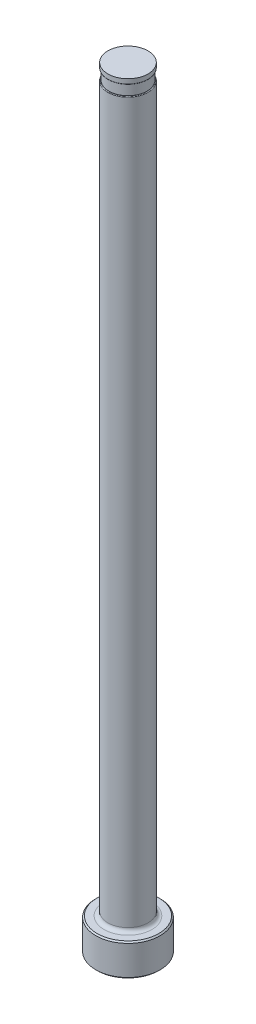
ISO-10303-21;
HEADER;
FILE_DESCRIPTION(('STEP AP214'),'2;1');
FILE_NAME('part.step','',(''),(''),'','','');
FILE_SCHEMA(('AUTOMOTIVE_DESIGN { 1 0 10303 214 1 1 1 1 }'));
ENDSEC;
DATA;
#1=APPLICATION_CONTEXT('core data for automotive mechanical design processes');
#2=APPLICATION_PROTOCOL_DEFINITION('international standard','automotive_design',2000,#1);
#3=PRODUCT_CONTEXT('',#1,'mechanical');
#4=PRODUCT('Part','Part','',(#3));
#5=PRODUCT_RELATED_PRODUCT_CATEGORY('part','',(#4));
#6=PRODUCT_DEFINITION_FORMATION('','',#4);
#7=PRODUCT_DEFINITION_CONTEXT('part definition',#1,'design');
#8=PRODUCT_DEFINITION('design','',#6,#7);
#9=PRODUCT_DEFINITION_SHAPE('','',#8);
#10=(LENGTH_UNIT() NAMED_UNIT(*) SI_UNIT(.MILLI.,.METRE.));
#11=(NAMED_UNIT(*) PLANE_ANGLE_UNIT() SI_UNIT($,.RADIAN.));
#12=(NAMED_UNIT(*) SI_UNIT($,.STERADIAN.) SOLID_ANGLE_UNIT());
#13=UNCERTAINTY_MEASURE_WITH_UNIT(LENGTH_MEASURE(1.E-05),#10,'distance_accuracy_value','');
#14=(GEOMETRIC_REPRESENTATION_CONTEXT(3) GLOBAL_UNCERTAINTY_ASSIGNED_CONTEXT((#13)) GLOBAL_UNIT_ASSIGNED_CONTEXT((#10,
#11,#12)) REPRESENTATION_CONTEXT('',''));
#15=CARTESIAN_POINT('',(0.,0.,0.));
#16=DIRECTION('',(0.,0.,1.));
#17=DIRECTION('',(1.,0.,0.));
#18=AXIS2_PLACEMENT_3D('',#15,#16,#17);
#19=CARTESIAN_POINT('',(-3.96874999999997,151.384,0.));
#20=DIRECTION('',(0.,1.,0.));
#21=DIRECTION('',(0.,0.,1.));
#22=AXIS2_PLACEMENT_3D('',#19,#20,#21);
#23=PLANE('',#22);
#24=CARTESIAN_POINT('',(0.,151.384,0.));
#25=DIRECTION('',(0.,1.,0.));
#26=DIRECTION('',(0.,0.,1.));
#27=AXIS2_PLACEMENT_3D('',#24,#25,#26);
#28=CIRCLE('',#27,3.83666999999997);
#29=CARTESIAN_POINT('',(0.,151.384,3.83666999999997));
#30=VERTEX_POINT('',#29);
#31=EDGE_CURVE('E11',#30,#30,#28,.F.);
#32=ORIENTED_EDGE('',*,*,#31,.T.);
#33=EDGE_LOOP('',(#32));
#34=FACE_BOUND('',#33,.T.);
#35=CARTESIAN_POINT('',(0.,151.384,0.));
#36=DIRECTION('',(0.,1.,0.));
#37=DIRECTION('',(0.,0.,1.));
#38=AXIS2_PLACEMENT_3D('',#35,#36,#37);
#39=CIRCLE('',#38,3.76554999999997);
#40=CARTESIAN_POINT('',(0.,151.384,3.76554999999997));
#41=VERTEX_POINT('',#40);
#42=EDGE_CURVE('E78',#41,#41,#39,.T.);
#43=ORIENTED_EDGE('',*,*,#42,.T.);
#44=EDGE_LOOP('',(#43));
#45=FACE_BOUND('',#44,.T.);
#46=ADVANCED_FACE('F36',(#34,#45),#23,.F.);
#47=CARTESIAN_POINT('',(0.,259.958771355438,0.));
#48=DIRECTION('',(0.,1.,0.));
#49=DIRECTION('',(0.,0.,1.));
#50=AXIS2_PLACEMENT_3D('',#47,#48,#49);
#51=CYLINDRICAL_SURFACE('',#50,3.96874999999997);
#52=DIRECTION('',(0.,1.,0.));
#53=VECTOR('',#52,1.);
#54=CARTESIAN_POINT('',(-3.76554999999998,259.958771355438,-1.25363860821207));
#55=LINE('',#54,#53);
#56=CARTESIAN_POINT('',(-3.76554999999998,149.225,-1.25363860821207));
#57=VERTEX_POINT('',#56);
#58=CARTESIAN_POINT('',(-3.76554999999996,86.868,-1.25363860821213));
#59=VERTEX_POINT('',#58);
#60=EDGE_CURVE('E73',#57,#59,#55,.F.);
#61=ORIENTED_EDGE('',*,*,#60,.F.);
#62=CARTESIAN_POINT('',(0.,149.225,0.));
#63=DIRECTION('',(0.,-1.,0.));
#64=DIRECTION('',(0.,0.,-1.));
#65=AXIS2_PLACEMENT_3D('',#62,#63,#64);
#66=CIRCLE('',#65,3.96874999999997);
#67=CARTESIAN_POINT('',(-3.76554999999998,149.225,1.25363860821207));
#68=VERTEX_POINT('',#67);
#69=EDGE_CURVE('E51',#57,#68,#66,.T.);
#70=ORIENTED_EDGE('',*,*,#69,.T.);
#71=DIRECTION('',(0.,1.,0.));
#72=VECTOR('',#71,1.);
#73=CARTESIAN_POINT('',(-3.76554999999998,259.958771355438,1.25363860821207));
#74=LINE('',#73,#72);
#75=CARTESIAN_POINT('',(-3.76554999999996,86.868,1.25363860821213));
#76=VERTEX_POINT('',#75);
#77=EDGE_CURVE('E84',#76,#68,#74,.T.);
#78=ORIENTED_EDGE('',*,*,#77,.F.);
#79=CARTESIAN_POINT('',(-3.76554999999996,86.868,-1.25363860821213));
#80=CARTESIAN_POINT('',(-3.76554761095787,86.8382664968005,-1.25363893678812));
#81=CARTESIAN_POINT('',(-3.76596820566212,86.8085487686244,-1.25238314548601));
#82=CARTESIAN_POINT('',(-3.76762981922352,86.7493538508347,-1.24737825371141));
#83=CARTESIAN_POINT('',(-3.76887065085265,86.7198766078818,-1.24362972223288));
#84=CARTESIAN_POINT('',(-3.77377172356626,86.6323445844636,-1.22871446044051));
#85=CARTESIAN_POINT('',(-3.7786109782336,86.5749361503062,-1.21387766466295));
#86=CARTESIAN_POINT('',(-3.79089599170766,86.4637164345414,-1.17494432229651));
#87=CARTESIAN_POINT('',(-3.79834108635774,86.4099042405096,-1.15085013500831));
#88=CARTESIAN_POINT('',(-3.81503450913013,86.3072087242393,-1.09423745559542));
#89=CARTESIAN_POINT('',(-3.82428345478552,86.2583270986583,-1.06171607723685));
#90=CARTESIAN_POINT('',(-3.84371902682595,86.166215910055,-0.989050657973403));
#91=CARTESIAN_POINT('',(-3.85391232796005,86.1230327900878,-0.948849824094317));
#92=CARTESIAN_POINT('',(-3.87421414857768,86.043439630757,-0.862218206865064));
#93=CARTESIAN_POINT('',(-3.88432263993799,86.0070317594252,-0.815785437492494));
#94=CARTESIAN_POINT('',(-3.90447970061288,85.9383203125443,-0.713424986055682));
#95=CARTESIAN_POINT('',(-3.91443636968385,85.9067071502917,-0.657016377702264));
#96=CARTESIAN_POINT('',(-3.93230837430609,85.8521594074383,-0.539855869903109));
#97=CARTESIAN_POINT('',(-3.94022284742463,85.8292284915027,-0.479102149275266));
#98=CARTESIAN_POINT('',(-3.95405226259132,85.7900681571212,-0.34816359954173));
#99=CARTESIAN_POINT('',(-3.95966879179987,85.774798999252,-0.277659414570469));
#100=CARTESIAN_POINT('',(-3.96709876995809,85.7547501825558,-0.134969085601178));
#101=CARTESIAN_POINT('',(-3.96891039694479,85.7499755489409,-0.0627821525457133));
#102=CARTESIAN_POINT('',(-3.96855474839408,85.7509169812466,0.086880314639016));
#103=CARTESIAN_POINT('',(-3.96608295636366,85.7574359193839,0.164351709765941));
#104=CARTESIAN_POINT('',(-3.95680487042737,85.7826115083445,0.317057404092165));
#105=CARTESIAN_POINT('',(-3.94999780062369,85.8012703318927,0.392291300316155));
#106=CARTESIAN_POINT('',(-3.93277618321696,85.8508426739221,0.538182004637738));
#107=CARTESIAN_POINT('',(-3.92236273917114,85.8817524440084,0.60884020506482));
#108=CARTESIAN_POINT('',(-3.8991687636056,85.9557930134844,0.743029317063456));
#109=CARTESIAN_POINT('',(-3.8863895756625,85.9989168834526,0.806564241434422));
#110=CARTESIAN_POINT('',(-3.86127801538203,86.092843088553,0.919000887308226));
#111=CARTESIAN_POINT('',(-3.84899411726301,86.1427331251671,0.968673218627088));
#112=CARTESIAN_POINT('',(-3.82552074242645,86.2513276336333,1.05758636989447));
#113=CARTESIAN_POINT('',(-3.81433058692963,86.3100265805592,1.09683368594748));
#114=CARTESIAN_POINT('',(-3.79578266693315,86.4273369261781,1.15929047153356));
#115=CARTESIAN_POINT('',(-3.78813455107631,86.4852068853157,1.18381204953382));
#116=CARTESIAN_POINT('',(-3.77592606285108,86.604640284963,1.22219984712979));
#117=CARTESIAN_POINT('',(-3.77135975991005,86.6661963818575,1.23608653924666));
#118=CARTESIAN_POINT('',(-3.76759831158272,86.7516117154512,1.24747178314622));
#119=CARTESIAN_POINT('',(-3.76683119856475,86.774841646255,1.24978469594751));
#120=CARTESIAN_POINT('',(-3.76580747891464,86.8213769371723,1.25286606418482));
#121=CARTESIAN_POINT('',(-3.76555004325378,86.8446821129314,1.25363702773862));
#122=CARTESIAN_POINT('',(-3.76554999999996,86.868,1.25363860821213));
#123=B_SPLINE_CURVE_WITH_KNOTS('',3,(#79,#80,#81,#82,#83,#84,#85,#86,#87,#88,#89,#90,#91,#92,
#93,#94,#95,#96,#97,#98,#99,#100,#101,#102,#103,#104,#105,#106,#107,#108,#109,#110,#111,#112,
#113,#114,#115,#116,#117,#118,#119,#120,#121,#122),.UNSPECIFIED.,.F.,.F.,(4,2,2,2,2,2,2,2,2,2,2,
2,2,2,2,2,2,2,2,2,2,4),(0.,0.0891400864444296,0.178259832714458,0.355749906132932,
0.533194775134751,0.710700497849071,0.88957367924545,1.06850400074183,1.26397301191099,
1.45952443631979,1.67567306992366,1.89192518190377,2.12418795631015,2.35649231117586,
2.58872564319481,2.82082748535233,3.03401201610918,3.24706339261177,3.43601078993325,
3.62459353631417,3.69462175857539,3.76453598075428),.UNSPECIFIED.);
#124=EDGE_CURVE('E81',#59,#76,#123,.T.);
#125=ORIENTED_EDGE('',*,*,#124,.F.);
#126=EDGE_LOOP('',(#61,#70,#78,#125));
#127=FACE_BOUND('',#126,.T.);
#128=CARTESIAN_POINT('',(0.,7.11200000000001,0.));
#129=DIRECTION('',(0.,1.,0.));
#130=DIRECTION('',(0.,0.,1.));
#131=AXIS2_PLACEMENT_3D('',#128,#129,#130);
#132=CIRCLE('',#131,3.96874999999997);
#133=CARTESIAN_POINT('',(0.,7.11200000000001,3.96874999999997));
#134=VERTEX_POINT('',#133);
#135=EDGE_CURVE('E116',#134,#134,#132,.T.);
#136=ORIENTED_EDGE('',*,*,#135,.T.);
#137=EDGE_LOOP('',(#136));
#138=FACE_BOUND('',#137,.T.);
#139=ADVANCED_FACE('F82',(#127,#138),#51,.T.);
#140=CARTESIAN_POINT('',(0.,0.,0.));
#141=DIRECTION('',(0.,-1.,0.));
#142=DIRECTION('',(0.,0.,-1.));
#143=AXIS2_PLACEMENT_3D('',#140,#141,#142);
#144=PLANE('',#143);
#145=CARTESIAN_POINT('',(0.,0.,0.));
#146=DIRECTION('',(0.,-1.,0.));
#147=DIRECTION('',(0.,0.,-1.));
#148=AXIS2_PLACEMENT_3D('',#145,#146,#147);
#149=CIRCLE('',#148,6.09599999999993);
#150=CARTESIAN_POINT('',(0.,0.,-6.09599999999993));
#151=VERTEX_POINT('',#150);
#152=EDGE_CURVE('E113',#151,#151,#149,.T.);
#153=ORIENTED_EDGE('',*,*,#152,.T.);
#154=EDGE_LOOP('',(#153));
#155=FACE_BOUND('',#154,.T.);
#156=ADVANCED_FACE('F192',(#155),#144,.T.);
#157=CARTESIAN_POINT('',(0.,259.958771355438,0.));
#158=DIRECTION('',(0.,1.,0.));
#159=DIRECTION('',(0.,0.,1.));
#160=AXIS2_PLACEMENT_3D('',#157,#158,#159);
#161=CYLINDRICAL_SURFACE('',#160,6.34999999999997);
#162=CARTESIAN_POINT('',(0.,6.09599999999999,0.));
#163=DIRECTION('',(0.,1.,0.));
#164=DIRECTION('',(0.,0.,1.));
#165=AXIS2_PLACEMENT_3D('',#162,#163,#164);
#166=CIRCLE('',#165,6.34999999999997);
#167=CARTESIAN_POINT('',(0.,6.09599999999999,6.34999999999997));
#168=VERTEX_POINT('',#167);
#169=EDGE_CURVE('E110',#168,#168,#166,.F.);
#170=ORIENTED_EDGE('',*,*,#169,.T.);
#171=EDGE_LOOP('',(#170));
#172=FACE_BOUND('',#171,.T.);
#173=CARTESIAN_POINT('',(0.,0.254000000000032,0.));
#174=DIRECTION('',(0.,-1.,0.));
#175=DIRECTION('',(0.,0.,-1.));
#176=AXIS2_PLACEMENT_3D('',#173,#174,#175);
#177=CIRCLE('',#176,6.34999999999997);
#178=CARTESIAN_POINT('',(0.,0.254000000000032,-6.34999999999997));
#179=VERTEX_POINT('',#178);
#180=EDGE_CURVE('E107',#179,#179,#177,.F.);
#181=ORIENTED_EDGE('',*,*,#180,.T.);
#182=EDGE_LOOP('',(#181));
#183=FACE_BOUND('',#182,.T.);
#184=ADVANCED_FACE('F195',(#172,#183),#161,.T.);
#185=CARTESIAN_POINT('',(-6.34999999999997,6.35,0.));
#186=DIRECTION('',(0.,1.,0.));
#187=DIRECTION('',(0.,0.,1.));
#188=AXIS2_PLACEMENT_3D('',#185,#186,#187);
#189=PLANE('',#188);
#190=CARTESIAN_POINT('',(0.,6.35,0.));
#191=DIRECTION('',(0.,1.,0.));
#192=DIRECTION('',(0.,0.,1.));
#193=AXIS2_PLACEMENT_3D('',#190,#191,#192);
#194=CIRCLE('',#193,4.73074999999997);
#195=CARTESIAN_POINT('',(0.,6.35,4.73074999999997));
#196=VERTEX_POINT('',#195);
#197=EDGE_CURVE('E87',#196,#196,#194,.F.);
#198=ORIENTED_EDGE('',*,*,#197,.T.);
#199=EDGE_LOOP('',(#198));
#200=FACE_BOUND('',#199,.T.);
#201=CARTESIAN_POINT('',(0.,6.35,0.));
#202=DIRECTION('',(0.,1.,0.));
#203=DIRECTION('',(0.,0.,1.));
#204=AXIS2_PLACEMENT_3D('',#201,#202,#203);
#205=CIRCLE('',#204,6.096);
#206=CARTESIAN_POINT('',(0.,6.35,6.096));
#207=VERTEX_POINT('',#206);
#208=EDGE_CURVE('E104',#207,#207,#205,.T.);
#209=ORIENTED_EDGE('',*,*,#208,.T.);
#210=EDGE_LOOP('',(#209));
#211=FACE_BOUND('',#210,.T.);
#212=ADVANCED_FACE('F190',(#200,#211),#189,.T.);
#213=CARTESIAN_POINT('',(0.,6.35000000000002,0.));
#214=DIRECTION('',(0.,-1.,0.));
#215=DIRECTION('',(0.,0.,-1.));
#216=AXIS2_PLACEMENT_3D('',#213,#214,#215);
#217=CONICAL_SURFACE('',#216,6.09599999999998,0.78539816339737);
#218=ORIENTED_EDGE('',*,*,#169,.F.);
#219=EDGE_LOOP('',(#218));
#220=FACE_BOUND('',#219,.T.);
#221=ORIENTED_EDGE('',*,*,#208,.F.);
#222=EDGE_LOOP('',(#221));
#223=FACE_BOUND('',#222,.T.);
#224=ADVANCED_FACE('F186',(#220,#223),#217,.T.);
#225=CARTESIAN_POINT('',(0.,0.254000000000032,0.));
#226=DIRECTION('',(0.,1.,0.));
#227=DIRECTION('',(0.,0.,1.));
#228=AXIS2_PLACEMENT_3D('',#225,#226,#227);
#229=CONICAL_SURFACE('',#228,6.34999999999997,0.785398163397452);
#230=ORIENTED_EDGE('',*,*,#152,.F.);
#231=EDGE_LOOP('',(#230));
#232=FACE_BOUND('',#231,.T.);
#233=ORIENTED_EDGE('',*,*,#180,.F.);
#234=EDGE_LOOP('',(#233));
#235=FACE_BOUND('',#234,.T.);
#236=ADVANCED_FACE('F182',(#232,#235),#229,.T.);
#237=CARTESIAN_POINT('',(0.,7.11200000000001,0.));
#238=DIRECTION('',(0.,1.,0.));
#239=DIRECTION('',(0.,0.,1.));
#240=AXIS2_PLACEMENT_3D('',#237,#238,#239);
#241=TOROIDAL_SURFACE('',#240,4.73074999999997,0.762);
#242=ORIENTED_EDGE('',*,*,#197,.F.);
#243=EDGE_LOOP('',(#242));
#244=FACE_BOUND('',#243,.T.);
#245=ORIENTED_EDGE('',*,*,#135,.F.);
#246=EDGE_LOOP('',(#245));
#247=FACE_BOUND('',#246,.T.);
#248=ADVANCED_FACE('F147',(#244,#247),#241,.F.);
#249=CARTESIAN_POINT('',(-3.96874999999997,149.352,0.));
#250=DIRECTION('',(0.,-1.,0.));
#251=DIRECTION('',(0.,0.,-1.));
#252=AXIS2_PLACEMENT_3D('',#249,#250,#251);
#253=PLANE('',#252);
#254=DIRECTION('',(0.,0.,1.));
#255=VECTOR('',#254,1.);
#256=CARTESIAN_POINT('',(-3.76554999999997,149.352,0.));
#257=LINE('',#256,#255);
#258=CARTESIAN_POINT('',(-3.76554999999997,149.352,0.));
#259=VERTEX_POINT('',#258);
#260=CARTESIAN_POINT('',(-3.76554999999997,149.352,0.761364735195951));
#261=VERTEX_POINT('',#260);
#262=EDGE_CURVE('E90',#259,#261,#257,.T.);
#263=ORIENTED_EDGE('',*,*,#262,.T.);
#264=CARTESIAN_POINT('',(0.,149.352,0.));
#265=DIRECTION('',(0.,-1.,0.));
#266=DIRECTION('',(0.,0.,-1.));
#267=AXIS2_PLACEMENT_3D('',#264,#265,#266);
#268=CIRCLE('',#267,3.84174999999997);
#269=CARTESIAN_POINT('',(-3.76554999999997,149.352,-0.761364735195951));
#270=VERTEX_POINT('',#269);
#271=EDGE_CURVE('E86',#261,#270,#268,.F.);
#272=ORIENTED_EDGE('',*,*,#271,.T.);
#273=EDGE_CURVE('E79',#270,#259,#257,.T.);
#274=ORIENTED_EDGE('',*,*,#273,.T.);
#275=CARTESIAN_POINT('',(0.,149.352,0.));
#276=DIRECTION('',(0.,1.,0.));
#277=DIRECTION('',(0.,0.,1.));
#278=AXIS2_PLACEMENT_3D('',#275,#276,#277);
#279=CIRCLE('',#278,3.76554999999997);
#280=EDGE_CURVE('E101',#259,#259,#279,.T.);
#281=ORIENTED_EDGE('',*,*,#280,.F.);
#282=EDGE_LOOP('',(#263,#272,#274,#281));
#283=FACE_BOUND('',#282,.T.);
#284=ADVANCED_FACE('F144',(#283),#253,.F.);
#285=CARTESIAN_POINT('',(0.,153.448281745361,0.));
#286=DIRECTION('',(0.,1.,0.));
#287=DIRECTION('',(0.,0.,1.));
#288=AXIS2_PLACEMENT_3D('',#285,#286,#287);
#289=CYLINDRICAL_SURFACE('',#288,3.76554999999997);
#290=ORIENTED_EDGE('',*,*,#42,.F.);
#291=EDGE_LOOP('',(#290));
#292=FACE_BOUND('',#291,.T.);
#293=ORIENTED_EDGE('',*,*,#280,.T.);
#294=EDGE_LOOP('',(#293));
#295=FACE_BOUND('',#294,.T.);
#296=ADVANCED_FACE('F141',(#292,#295),#289,.T.);
#297=CARTESIAN_POINT('',(-3.76554999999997,150.368,-6.34999999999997));
#298=DIRECTION('',(1.,0.,0.));
#299=DIRECTION('',(0.,1.,0.));
#300=AXIS2_PLACEMENT_3D('',#297,#298,#299);
#301=PLANE('',#300);
#302=ORIENTED_EDGE('',*,*,#273,.F.);
#303=CARTESIAN_POINT('',(-3.76554999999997,149.352,-0.761364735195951));
#304=CARTESIAN_POINT('',(-3.76554999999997,149.351994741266,-0.782493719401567));
#305=CARTESIAN_POINT('',(-3.76554999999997,149.351792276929,-0.803626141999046));
#306=CARTESIAN_POINT('',(-3.76554999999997,149.350859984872,-0.845902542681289));
#307=CARTESIAN_POINT('',(-3.76554999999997,149.350129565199,-0.867046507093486));
#308=CARTESIAN_POINT('',(-3.76554999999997,149.348000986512,-0.909439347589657));
#309=CARTESIAN_POINT('',(-3.76554999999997,149.346598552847,-0.930688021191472));
#310=CARTESIAN_POINT('',(-3.76554999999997,149.342932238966,-0.973104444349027));
#311=CARTESIAN_POINT('',(-3.76554999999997,149.340668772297,-0.994272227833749));
#312=CARTESIAN_POINT('',(-3.76554999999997,149.335963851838,-1.02925031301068));
#313=CARTESIAN_POINT('',(-3.76554999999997,149.333847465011,-1.04310326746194));
#314=CARTESIAN_POINT('',(-3.76554999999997,149.328992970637,-1.07067599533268));
#315=CARTESIAN_POINT('',(-3.76554999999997,149.326255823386,-1.08439594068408));
#316=CARTESIAN_POINT('',(-3.76554999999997,149.318714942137,-1.11722771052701));
#317=CARTESIAN_POINT('',(-3.76554999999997,149.313523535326,-1.13626053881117));
#318=CARTESIAN_POINT('',(-3.76554999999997,149.303554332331,-1.16502851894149));
#319=CARTESIAN_POINT('',(-3.76554999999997,149.299656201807,-1.17506664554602));
#320=CARTESIAN_POINT('',(-3.76554999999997,149.290804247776,-1.19465815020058));
#321=CARTESIAN_POINT('',(-3.76554999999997,149.285854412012,-1.20421319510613));
#322=CARTESIAN_POINT('',(-3.76554999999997,149.277843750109,-1.21677899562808));
#323=CARTESIAN_POINT('',(-3.76554999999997,149.275472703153,-1.22022603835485));
#324=CARTESIAN_POINT('',(-3.76554999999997,149.270417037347,-1.22689753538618));
#325=CARTESIAN_POINT('',(-3.76554999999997,149.267731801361,-1.23012153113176));
#326=CARTESIAN_POINT('',(-3.76554999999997,149.261951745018,-1.23626135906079));
#327=CARTESIAN_POINT('',(-3.76554999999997,149.258852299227,-1.23917292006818));
#328=CARTESIAN_POINT('',(-3.76554999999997,149.252201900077,-1.24442799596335));
#329=CARTESIAN_POINT('',(-3.76554999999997,149.248652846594,-1.24677378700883));
#330=CARTESIAN_POINT('',(-3.76554999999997,149.242648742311,-1.24979676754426));
#331=CARTESIAN_POINT('',(-3.76554999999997,149.240340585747,-1.25076391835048));
#332=CARTESIAN_POINT('',(-3.76554999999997,149.235598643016,-1.25230606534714));
#333=CARTESIAN_POINT('',(-3.76554999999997,149.233165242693,-1.25288219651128));
#334=CARTESIAN_POINT('',(-3.76554999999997,149.229758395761,-1.25336754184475));
#335=CARTESIAN_POINT('',(-3.76554999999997,149.228810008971,-1.25346893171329));
#336=CARTESIAN_POINT('',(-3.76554999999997,149.226907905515,-1.25360450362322));
#337=CARTESIAN_POINT('',(-3.76554999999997,149.225954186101,-1.25363864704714));
#338=CARTESIAN_POINT('',(-3.76554999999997,149.225,-1.25363860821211));
#339=B_SPLINE_CURVE_WITH_KNOTS('',3,(#303,#304,#305,#306,#307,#308,#309,#310,#311,#312,#313,
#314,#315,#316,#317,#318,#319,#320,#321,#322,#323,#324,#325,#326,#327,#328,#329,#330,#331,#332,
#333,#334,#335,#336,#337,#338),.UNSPECIFIED.,.F.,.F.,(4,2,2,2,2,2,2,2,2,2,2,2,2,2,2,2,2,4),(0.,
0.0633913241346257,0.126853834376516,0.190725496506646,0.254566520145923,0.296594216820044,
0.338557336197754,0.397605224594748,0.429880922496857,0.462036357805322,0.474575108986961,
0.487138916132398,0.499857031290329,0.512523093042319,0.520004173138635,0.527463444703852,
0.530322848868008,0.533183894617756),.UNSPECIFIED.);
#340=EDGE_CURVE('E59',#270,#57,#339,.T.);
#341=ORIENTED_EDGE('',*,*,#340,.T.);
#342=ORIENTED_EDGE('',*,*,#60,.T.);
#343=DIRECTION('',(0.,0.,1.));
#344=VECTOR('',#343,1.);
#345=CARTESIAN_POINT('',(-3.76554999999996,86.868,-6.34999999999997));
#346=LINE('',#345,#344);
#347=EDGE_CURVE('E77',#59,#76,#346,.T.);
#348=ORIENTED_EDGE('',*,*,#347,.T.);
#349=ORIENTED_EDGE('',*,*,#77,.T.);
#350=CARTESIAN_POINT('',(-3.76554999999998,149.225,1.25363860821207));
#351=CARTESIAN_POINT('',(-3.76554999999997,149.227613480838,1.25364684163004));
#352=CARTESIAN_POINT('',(-3.76554999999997,149.230215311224,1.25338363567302));
#353=CARTESIAN_POINT('',(-3.76554999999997,149.235293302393,1.25239294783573));
#354=CARTESIAN_POINT('',(-3.76554999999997,149.237770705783,1.25167195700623));
#355=CARTESIAN_POINT('',(-3.76554999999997,149.243154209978,1.24961912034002));
#356=CARTESIAN_POINT('',(-3.76554999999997,149.246019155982,1.24818173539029));
#357=CARTESIAN_POINT('',(-3.76554999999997,149.251493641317,1.24486563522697));
#358=CARTESIAN_POINT('',(-3.76554999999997,149.25410160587,1.24298441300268));
#359=CARTESIAN_POINT('',(-3.76554999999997,149.260800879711,1.23749178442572));
#360=CARTESIAN_POINT('',(-3.76554999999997,149.264652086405,1.23359127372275));
#361=CARTESIAN_POINT('',(-3.76554999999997,149.271763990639,1.22529610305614));
#362=CARTESIAN_POINT('',(-3.76554999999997,149.275023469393,1.22090045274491));
#363=CARTESIAN_POINT('',(-3.76554999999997,149.286610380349,1.203601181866));
#364=CARTESIAN_POINT('',(-3.76554999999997,149.293424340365,1.18970762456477));
#365=CARTESIAN_POINT('',(-3.76554999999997,149.305184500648,1.16115732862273));
#366=CARTESIAN_POINT('',(-3.76554999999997,149.310117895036,1.1464961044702));
#367=CARTESIAN_POINT('',(-3.76554999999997,149.321974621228,1.10570448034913));
#368=CARTESIAN_POINT('',(-3.76554999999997,149.327623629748,1.07920308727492));
#369=CARTESIAN_POINT('',(-3.76554999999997,149.33673714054,1.0258152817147));
#370=CARTESIAN_POINT('',(-3.76554999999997,149.340195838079,0.99892803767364));
#371=CARTESIAN_POINT('',(-3.76554999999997,149.345595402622,0.944998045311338));
#372=CARTESIAN_POINT('',(-3.76554999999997,149.347536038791,0.9179552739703));
#373=CARTESIAN_POINT('',(-3.76554999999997,149.350323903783,0.863847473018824));
#374=CARTESIAN_POINT('',(-3.76554999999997,149.351172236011,0.836782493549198));
#375=CARTESIAN_POINT('',(-3.76554999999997,149.351747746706,0.801647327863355));
#376=CARTESIAN_POINT('',(-3.76554999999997,149.35184390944,0.793581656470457));
#377=CARTESIAN_POINT('',(-3.76554999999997,149.351969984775,0.777465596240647));
#378=CARTESIAN_POINT('',(-3.76554999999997,149.352000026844,0.769415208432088));
#379=CARTESIAN_POINT('',(-3.76554999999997,149.352,0.761364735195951));
#380=B_SPLINE_CURVE_WITH_KNOTS('',3,(#350,#351,#352,#353,#354,#355,#356,#357,#358,#359,#360,
#361,#362,#363,#364,#365,#366,#367,#368,#369,#370,#371,#372,#373,#374,#375,#376,#377,#378,#379),
.UNSPECIFIED.,.F.,.F.,(4,2,2,2,2,2,2,2,2,2,2,2,2,2,4),(0.,0.00780850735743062,
0.0155086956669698,0.0250704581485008,0.0346875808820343,0.0510390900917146,0.0674239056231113,
0.113484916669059,0.159854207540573,0.240929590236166,0.322218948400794,0.403520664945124,
0.484740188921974,0.508938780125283,0.533089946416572),.UNSPECIFIED.);
#381=EDGE_CURVE('E172',#68,#261,#380,.T.);
#382=ORIENTED_EDGE('',*,*,#381,.T.);
#383=ORIENTED_EDGE('',*,*,#262,.F.);
#384=EDGE_LOOP('',(#302,#341,#342,#348,#349,#382,#383));
#385=FACE_BOUND('',#384,.T.);
#386=ADVANCED_FACE('F75',(#385),#301,.F.);
#387=CARTESIAN_POINT('',(-6.94054999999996,86.868,-6.34999999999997));
#388=DIRECTION('',(0.,0.,1.));
#389=DIRECTION('',(1.,0.,0.));
#390=AXIS2_PLACEMENT_3D('',#387,#388,#389);
#391=CYLINDRICAL_SURFACE('',#390,3.175);
#392=ORIENTED_EDGE('',*,*,#347,.F.);
#393=ORIENTED_EDGE('',*,*,#124,.T.);
#394=EDGE_LOOP('',(#392,#393));
#395=FACE_BOUND('',#394,.T.);
#396=ADVANCED_FACE('F89',(#395),#391,.F.);
#397=CARTESIAN_POINT('',(0.,152.687735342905,0.));
#398=DIRECTION('',(0.,1.,0.));
#399=DIRECTION('',(0.,0.,1.));
#400=AXIS2_PLACEMENT_3D('',#397,#398,#399);
#401=CYLINDRICAL_SURFACE('',#400,3.96366999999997);
#402=CARTESIAN_POINT('',(0.,151.511,0.));
#403=DIRECTION('',(0.,1.,0.));
#404=DIRECTION('',(0.,0.,1.));
#405=AXIS2_PLACEMENT_3D('',#402,#403,#404);
#406=CIRCLE('',#405,3.96366999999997);
#407=CARTESIAN_POINT('',(0.,151.511,3.96366999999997));
#408=VERTEX_POINT('',#407);
#409=EDGE_CURVE('E44',#408,#408,#406,.T.);
#410=ORIENTED_EDGE('',*,*,#409,.T.);
#411=EDGE_LOOP('',(#410));
#412=FACE_BOUND('',#411,.T.);
#413=CARTESIAN_POINT('',(0.,152.4,0.));
#414=DIRECTION('',(0.,1.,0.));
#415=DIRECTION('',(0.,0.,1.));
#416=AXIS2_PLACEMENT_3D('',#413,#414,#415);
#417=CIRCLE('',#416,3.96366999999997);
#418=CARTESIAN_POINT('',(0.,152.4,3.96366999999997));
#419=VERTEX_POINT('',#418);
#420=EDGE_CURVE('E91',#419,#419,#417,.T.);
#421=ORIENTED_EDGE('',*,*,#420,.F.);
#422=EDGE_LOOP('',(#421));
#423=FACE_BOUND('',#422,.T.);
#424=ADVANCED_FACE('F135',(#412,#423),#401,.T.);
#425=CARTESIAN_POINT('',(-3.96874999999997,152.4,0.));
#426=DIRECTION('',(0.,1.,0.));
#427=DIRECTION('',(0.,0.,1.));
#428=AXIS2_PLACEMENT_3D('',#425,#426,#427);
#429=PLANE('',#428);
#430=ORIENTED_EDGE('',*,*,#420,.T.);
#431=EDGE_LOOP('',(#430));
#432=FACE_BOUND('',#431,.T.);
#433=ADVANCED_FACE('F149',(#432),#429,.T.);
#434=CARTESIAN_POINT('',(0.,149.225,0.));
#435=DIRECTION('',(0.,-1.,0.));
#436=DIRECTION('',(0.,0.,-1.));
#437=AXIS2_PLACEMENT_3D('',#434,#435,#436);
#438=TOROIDAL_SURFACE('',#437,3.84174999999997,0.127);
#439=ORIENTED_EDGE('',*,*,#381,.F.);
#440=ORIENTED_EDGE('',*,*,#69,.F.);
#441=ORIENTED_EDGE('',*,*,#340,.F.);
#442=ORIENTED_EDGE('',*,*,#271,.F.);
#443=EDGE_LOOP('',(#439,#440,#441,#442));
#444=FACE_BOUND('',#443,.T.);
#445=ADVANCED_FACE('F151',(#444),#438,.T.);
#446=CARTESIAN_POINT('',(0.,151.511,0.));
#447=DIRECTION('',(0.,1.,0.));
#448=DIRECTION('',(0.,0.,1.));
#449=AXIS2_PLACEMENT_3D('',#446,#447,#448);
#450=TOROIDAL_SURFACE('',#449,3.83666999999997,0.127);
#451=ORIENTED_EDGE('',*,*,#31,.F.);
#452=EDGE_LOOP('',(#451));
#453=FACE_BOUND('',#452,.T.);
#454=ORIENTED_EDGE('',*,*,#409,.F.);
#455=EDGE_LOOP('',(#454));
#456=FACE_BOUND('',#455,.T.);
#457=ADVANCED_FACE('F38',(#453,#456),#450,.T.);
#458=CLOSED_SHELL('',(#46,#139,#156,#184,#212,#224,#236,#248,#284,#296,#386,#396,#424,#433,#445,#457));
#459=MANIFOLD_SOLID_BREP('B2',#458);
#460=ADVANCED_BREP_SHAPE_REPRESENTATION('',(#18,#459),#14);
#461=SHAPE_DEFINITION_REPRESENTATION(#9,#460);
ENDSEC;
END-ISO-10303-21;
